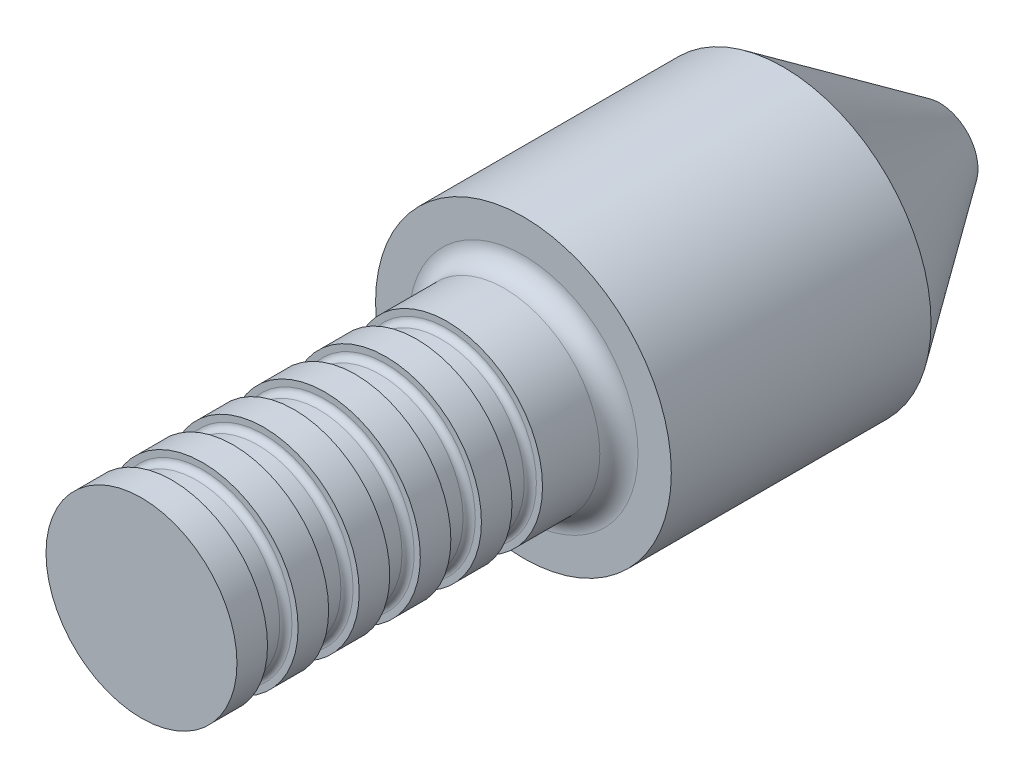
from build123d import *


with BuildPart() as part:
    # Sketch2 → Revolve1 (revolve)
    with BuildSketch(Plane(origin=(0, 0, 0), x_dir=(0, 0, -1), z_dir=(1, 0, 0)), mode=Mode.PRIVATE) as revolve1_sk:
        with BuildLine():
            Line((0, 0), (0, 3.96875))
            Line((0, 3.96875), (1.27, 3.96875))
            Line((1.27, 3.96875), (1.27, 3.71475))
            ThreePointArc((1.27, 3.71475), (1.344394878, 3.535144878), (1.524, 3.46075))
            Line((1.524, 3.46075), (2.286, 3.46075))
            ThreePointArc((2.286, 3.46075), (2.465605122, 3.535144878), (2.54, 3.71475))
            Line((2.54, 3.71475), (2.54, 3.96875))
            Line((2.54, 3.96875), (3.81, 3.96875))
            Line((3.81, 3.96875), (3.81, 3.71475))
            ThreePointArc((3.81, 3.71475), (3.884394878, 3.535144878), (4.064, 3.46075))
            Line((4.064, 3.46075), (4.826, 3.46075))
            ThreePointArc((4.826, 3.46075), (5.005605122, 3.535144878), (5.08, 3.71475))
            Line((5.08, 3.71475), (5.08, 3.96875))
            Line((5.08, 3.96875), (6.35, 3.96875))
            Line((6.35, 3.96875), (6.35, 3.71475))
            ThreePointArc((6.35, 3.71475), (6.424394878, 3.535144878), (6.604, 3.46075))
            Line((6.604, 3.46075), (7.366, 3.46075))
            ThreePointArc((7.366, 3.46075), (7.545605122, 3.535144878), (7.62, 3.71475))
            Line((7.62, 3.71475), (7.62, 3.96875))
            Line((7.62, 3.96875), (8.89, 3.96875))
            Line((8.89, 3.96875), (8.89, 3.71475))
            ThreePointArc((8.89, 3.71475), (8.964394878, 3.535144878), (9.144, 3.46075))
            Line((9.144, 3.46075), (9.906, 3.46075))
            ThreePointArc((9.906, 3.46075), (10.085605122, 3.535144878), (10.16, 3.71475))
            Line((10.16, 3.71475), (10.16, 3.96875))
            Line((10.16, 3.96875), (11.43, 3.96875))
            Line((11.43, 3.96875), (11.43, 3.71475))
            ThreePointArc((11.43, 3.71475), (11.504394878, 3.535144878), (11.684, 3.46075))
            Line((11.684, 3.46075), (12.446, 3.46075))
            ThreePointArc((12.446, 3.46075), (12.625605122, 3.535144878), (12.7, 3.71475))
            Line((12.7, 3.71475), (12.7, 3.96875))
            Line((12.7, 3.96875), (15.08125, 3.96875))
            ThreePointArc((15.08125, 3.96875), (15.642516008, 4.201233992), (15.875, 4.7625))
            Line((15.875, 4.7625), (15.875, 6.1468))
            Line((15.875, 6.1468), (26.67, 6.1468))
            Line((26.67, 6.1468), (33.181355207, 1.5875))
            Line((33.181355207, 1.5875), (31.593855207, 1.5875))
            Line((31.593855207, 1.5875), (30.639988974, 0))
            Line((30.639988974, 0), (0, 0))
        make_face()
    revolve(revolve1_sk.sketch.rotate(Axis((0, 0, 0), (0, 0, -1)), 90), axis=Axis((0, 0, 0), (0, 0, -1)))


solid = part.part
